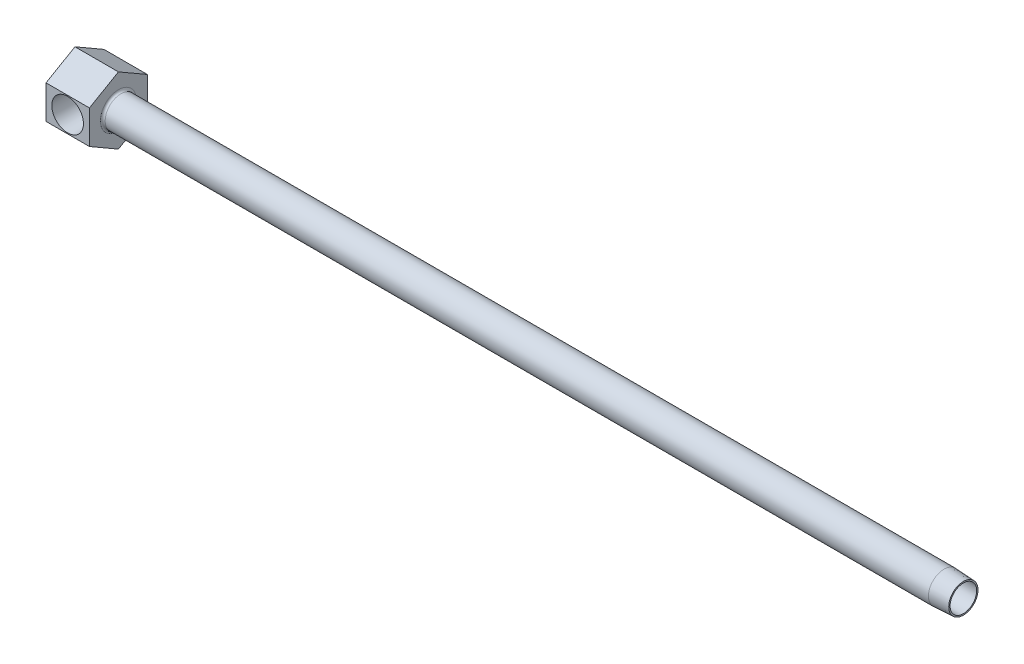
ISO-10303-21;
HEADER;
FILE_DESCRIPTION(('STEP AP214'),'2;1');
FILE_NAME('part.step','',(''),(''),'','','');
FILE_SCHEMA(('AUTOMOTIVE_DESIGN { 1 0 10303 214 1 1 1 1 }'));
ENDSEC;
DATA;
#1=APPLICATION_CONTEXT('core data for automotive mechanical design processes');
#2=APPLICATION_PROTOCOL_DEFINITION('international standard','automotive_design',2000,#1);
#3=PRODUCT_CONTEXT('',#1,'mechanical');
#4=PRODUCT('Part','Part','',(#3));
#5=PRODUCT_RELATED_PRODUCT_CATEGORY('part','',(#4));
#6=PRODUCT_DEFINITION_FORMATION('','',#4);
#7=PRODUCT_DEFINITION_CONTEXT('part definition',#1,'design');
#8=PRODUCT_DEFINITION('design','',#6,#7);
#9=PRODUCT_DEFINITION_SHAPE('','',#8);
#10=(LENGTH_UNIT() NAMED_UNIT(*) SI_UNIT(.MILLI.,.METRE.));
#11=(NAMED_UNIT(*) PLANE_ANGLE_UNIT() SI_UNIT($,.RADIAN.));
#12=(NAMED_UNIT(*) SI_UNIT($,.STERADIAN.) SOLID_ANGLE_UNIT());
#13=UNCERTAINTY_MEASURE_WITH_UNIT(LENGTH_MEASURE(1.E-05),#10,'distance_accuracy_value','');
#14=(GEOMETRIC_REPRESENTATION_CONTEXT(3) GLOBAL_UNCERTAINTY_ASSIGNED_CONTEXT((#13)) GLOBAL_UNIT_ASSIGNED_CONTEXT((#10,
#11,#12)) REPRESENTATION_CONTEXT('',''));
#15=CARTESIAN_POINT('',(0.,0.,0.));
#16=DIRECTION('',(0.,0.,1.));
#17=DIRECTION('',(1.,0.,0.));
#18=AXIS2_PLACEMENT_3D('',#15,#16,#17);
#19=CARTESIAN_POINT('',(7.14375,0.,9.525));
#20=DIRECTION('',(1.,0.,0.));
#21=DIRECTION('',(0.,0.,-1.));
#22=AXIS2_PLACEMENT_3D('',#19,#20,#21);
#23=PLANE('',#22);
#24=DIRECTION('',(0.,0.,1.));
#25=VECTOR('',#24,1.);
#26=CARTESIAN_POINT('',(7.14375,4.21628045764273,19.05));
#27=LINE('',#26,#25);
#28=CARTESIAN_POINT('',(7.14375,4.21628045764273,8.39289543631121));
#29=VERTEX_POINT('',#28);
#30=CARTESIAN_POINT('',(7.14375,4.21628045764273,10.16));
#31=VERTEX_POINT('',#30);
#32=EDGE_CURVE('E280',#29,#31,#27,.T.);
#33=ORIENTED_EDGE('',*,*,#32,.F.);
#34=CARTESIAN_POINT('',(7.14375,0.,9.525));
#35=DIRECTION('',(1.,0.,0.));
#36=DIRECTION('',(0.,0.,-1.));
#37=AXIS2_PLACEMENT_3D('',#34,#35,#36);
#38=CIRCLE('',#37,4.365625);
#39=CARTESIAN_POINT('',(7.14375,4.31919629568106,10.16));
#40=VERTEX_POINT('',#39);
#41=EDGE_CURVE('E163',#29,#40,#38,.T.);
#42=ORIENTED_EDGE('',*,*,#41,.T.);
#43=DIRECTION('',(0.,1.,0.));
#44=VECTOR('',#43,1.);
#45=CARTESIAN_POINT('',(7.14375,0.,10.16));
#46=LINE('',#45,#44);
#47=EDGE_CURVE('E153',#31,#40,#46,.T.);
#48=ORIENTED_EDGE('',*,*,#47,.F.);
#49=EDGE_LOOP('',(#33,#42,#48));
#50=FACE_BOUND('',#49,.T.);
#51=ADVANCED_FACE('F15',(#50),#23,.T.);
#52=CARTESIAN_POINT('',(14.2875,5.4992613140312,19.05));
#53=DIRECTION('',(0.,0.,-1.));
#54=DIRECTION('',(-1.,0.,0.));
#55=AXIS2_PLACEMENT_3D('',#52,#53,#54);
#56=PLANE('',#55);
#57=CARTESIAN_POINT('',(7.112,0.,19.05));
#58=DIRECTION('',(0.,0.,1.));
#59=DIRECTION('',(1.,0.,0.));
#60=AXIS2_PLACEMENT_3D('',#57,#58,#59);
#61=CIRCLE('',#60,5.2023645);
#62=CARTESIAN_POINT('',(12.3143645,0.,19.05));
#63=VERTEX_POINT('',#62);
#64=EDGE_CURVE('E269',#63,#63,#61,.T.);
#65=ORIENTED_EDGE('',*,*,#64,.F.);
#66=EDGE_LOOP('',(#65));
#67=FACE_BOUND('',#66,.T.);
#68=DIRECTION('',(0.,-1.,0.));
#69=VECTOR('',#68,1.);
#70=CARTESIAN_POINT('',(0.,5.4992613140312,19.05));
#71=LINE('',#70,#69);
#72=CARTESIAN_POINT('',(0.,5.4992613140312,19.05));
#73=VERTEX_POINT('',#72);
#74=CARTESIAN_POINT('',(0.,-5.49926131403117,19.05));
#75=VERTEX_POINT('',#74);
#76=EDGE_CURVE('E178',#73,#75,#71,.T.);
#77=ORIENTED_EDGE('',*,*,#76,.T.);
#78=DIRECTION('',(-1.,0.,0.));
#79=VECTOR('',#78,1.);
#80=CARTESIAN_POINT('',(14.2875,-5.49926131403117,19.05));
#81=LINE('',#80,#79);
#82=CARTESIAN_POINT('',(14.2875,-5.49926131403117,19.05));
#83=VERTEX_POINT('',#82);
#84=EDGE_CURVE('E201',#83,#75,#81,.T.);
#85=ORIENTED_EDGE('',*,*,#84,.F.);
#86=DIRECTION('',(0.,-1.,0.));
#87=VECTOR('',#86,1.);
#88=CARTESIAN_POINT('',(14.2875,5.4992613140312,19.05));
#89=LINE('',#88,#87);
#90=CARTESIAN_POINT('',(14.2875,5.4992613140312,19.05));
#91=VERTEX_POINT('',#90);
#92=EDGE_CURVE('E194',#91,#83,#89,.T.);
#93=ORIENTED_EDGE('',*,*,#92,.F.);
#94=DIRECTION('',(-1.,0.,0.));
#95=VECTOR('',#94,1.);
#96=CARTESIAN_POINT('',(14.2875,5.4992613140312,19.05));
#97=LINE('',#96,#95);
#98=EDGE_CURVE('E204',#91,#73,#97,.T.);
#99=ORIENTED_EDGE('',*,*,#98,.T.);
#100=EDGE_LOOP('',(#77,#85,#93,#99));
#101=FACE_BOUND('',#100,.T.);
#102=ADVANCED_FACE('F119',(#67,#101),#56,.F.);
#103=CARTESIAN_POINT('',(14.2875,-5.49926131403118,0.));
#104=DIRECTION('',(1.,0.,0.));
#105=DIRECTION('',(0.,1.,0.));
#106=AXIS2_PLACEMENT_3D('',#103,#104,#105);
#107=PLANE('',#106);
#108=CARTESIAN_POINT('',(14.2875,0.,9.525));
#109=DIRECTION('',(1.,0.,0.));
#110=DIRECTION('',(0.,1.,0.));
#111=AXIS2_PLACEMENT_3D('',#108,#109,#110);
#112=CIRCLE('',#111,5.9309);
#113=CARTESIAN_POINT('',(14.2875,5.9309,9.525));
#114=VERTEX_POINT('',#113);
#115=EDGE_CURVE('E216',#114,#114,#112,.F.);
#116=ORIENTED_EDGE('',*,*,#115,.T.);
#117=EDGE_LOOP('',(#116));
#118=FACE_BOUND('',#117,.T.);
#119=DIRECTION('',(0.,0.5,-0.866025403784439));
#120=VECTOR('',#119,1.);
#121=CARTESIAN_POINT('',(14.2875,-10.9985226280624,9.525));
#122=LINE('',#121,#120);
#123=CARTESIAN_POINT('',(14.2875,-10.9985226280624,9.525));
#124=VERTEX_POINT('',#123);
#125=CARTESIAN_POINT('',(14.2875,-5.49926131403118,0.));
#126=VERTEX_POINT('',#125);
#127=EDGE_CURVE('E184',#124,#126,#122,.T.);
#128=ORIENTED_EDGE('',*,*,#127,.T.);
#129=DIRECTION('',(0.,1.,0.));
#130=VECTOR('',#129,1.);
#131=CARTESIAN_POINT('',(14.2875,-5.49926131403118,0.));
#132=LINE('',#131,#130);
#133=CARTESIAN_POINT('',(14.2875,5.49926131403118,0.));
#134=VERTEX_POINT('',#133);
#135=EDGE_CURVE('E188',#126,#134,#132,.T.);
#136=ORIENTED_EDGE('',*,*,#135,.T.);
#137=DIRECTION('',(0.,0.5,0.866025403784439));
#138=VECTOR('',#137,1.);
#139=CARTESIAN_POINT('',(14.2875,5.49926131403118,0.));
#140=LINE('',#139,#138);
#141=CARTESIAN_POINT('',(14.2875,10.9985226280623,9.525));
#142=VERTEX_POINT('',#141);
#143=EDGE_CURVE('E190',#134,#142,#140,.T.);
#144=ORIENTED_EDGE('',*,*,#143,.T.);
#145=DIRECTION('',(0.,-0.5,0.86602540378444));
#146=VECTOR('',#145,1.);
#147=CARTESIAN_POINT('',(14.2875,10.9985226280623,9.525));
#148=LINE('',#147,#146);
#149=EDGE_CURVE('E192',#142,#91,#148,.T.);
#150=ORIENTED_EDGE('',*,*,#149,.T.);
#151=ORIENTED_EDGE('',*,*,#92,.T.);
#152=DIRECTION('',(0.,-0.5,-0.866025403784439));
#153=VECTOR('',#152,1.);
#154=CARTESIAN_POINT('',(14.2875,-5.49926131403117,19.05));
#155=LINE('',#154,#153);
#156=EDGE_CURVE('E38',#83,#124,#155,.T.);
#157=ORIENTED_EDGE('',*,*,#156,.T.);
#158=EDGE_LOOP('',(#128,#136,#144,#150,#151,#157));
#159=FACE_BOUND('',#158,.T.);
#160=ADVANCED_FACE('F127',(#118,#159),#107,.T.);
#161=CARTESIAN_POINT('',(14.2875,-10.9985226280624,9.525));
#162=DIRECTION('',(0.,0.866025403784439,0.5));
#163=DIRECTION('',(0.,-0.5,0.866025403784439));
#164=AXIS2_PLACEMENT_3D('',#161,#162,#163);
#165=PLANE('',#164);
#166=DIRECTION('',(0.,0.5,-0.866025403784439));
#167=VECTOR('',#166,1.);
#168=CARTESIAN_POINT('',(0.,-10.9985226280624,9.525));
#169=LINE('',#168,#167);
#170=CARTESIAN_POINT('',(0.,-10.9985226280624,9.525));
#171=VERTEX_POINT('',#170);
#172=CARTESIAN_POINT('',(0.,-5.49926131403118,0.));
#173=VERTEX_POINT('',#172);
#174=EDGE_CURVE('E166',#171,#173,#169,.T.);
#175=ORIENTED_EDGE('',*,*,#174,.T.);
#176=DIRECTION('',(-1.,0.,0.));
#177=VECTOR('',#176,1.);
#178=CARTESIAN_POINT('',(14.2875,-5.49926131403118,0.));
#179=LINE('',#178,#177);
#180=EDGE_CURVE('E213',#126,#173,#179,.T.);
#181=ORIENTED_EDGE('',*,*,#180,.F.);
#182=ORIENTED_EDGE('',*,*,#127,.F.);
#183=DIRECTION('',(-1.,0.,0.));
#184=VECTOR('',#183,1.);
#185=CARTESIAN_POINT('',(14.2875,-10.9985226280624,9.525));
#186=LINE('',#185,#184);
#187=EDGE_CURVE('E197',#124,#171,#186,.T.);
#188=ORIENTED_EDGE('',*,*,#187,.T.);
#189=EDGE_LOOP('',(#175,#181,#182,#188));
#190=FACE_BOUND('',#189,.T.);
#191=ADVANCED_FACE('F301',(#190),#165,.F.);
#192=CARTESIAN_POINT('',(14.2875,-5.49926131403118,0.));
#193=DIRECTION('',(0.,0.,1.));
#194=DIRECTION('',(0.,-1.,0.));
#195=AXIS2_PLACEMENT_3D('',#192,#193,#194);
#196=PLANE('',#195);
#197=DIRECTION('',(0.,1.,0.));
#198=VECTOR('',#197,1.);
#199=CARTESIAN_POINT('',(0.,-5.49926131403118,0.));
#200=LINE('',#199,#198);
#201=CARTESIAN_POINT('',(0.,5.49926131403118,0.));
#202=VERTEX_POINT('',#201);
#203=EDGE_CURVE('E169',#173,#202,#200,.T.);
#204=ORIENTED_EDGE('',*,*,#203,.T.);
#205=DIRECTION('',(-1.,0.,0.));
#206=VECTOR('',#205,1.);
#207=CARTESIAN_POINT('',(14.2875,5.49926131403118,0.));
#208=LINE('',#207,#206);
#209=EDGE_CURVE('E210',#134,#202,#208,.T.);
#210=ORIENTED_EDGE('',*,*,#209,.F.);
#211=ORIENTED_EDGE('',*,*,#135,.F.);
#212=ORIENTED_EDGE('',*,*,#180,.T.);
#213=EDGE_LOOP('',(#204,#210,#211,#212));
#214=FACE_BOUND('',#213,.T.);
#215=ADVANCED_FACE('F307',(#214),#196,.F.);
#216=CARTESIAN_POINT('',(14.2875,5.49926131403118,0.));
#217=DIRECTION('',(0.,-0.866025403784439,0.5));
#218=DIRECTION('',(0.,-0.5,-0.866025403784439));
#219=AXIS2_PLACEMENT_3D('',#216,#217,#218);
#220=PLANE('',#219);
#221=DIRECTION('',(0.,0.5,0.866025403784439));
#222=VECTOR('',#221,1.);
#223=CARTESIAN_POINT('',(0.,5.49926131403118,0.));
#224=LINE('',#223,#222);
#225=CARTESIAN_POINT('',(0.,10.9985226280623,9.525));
#226=VERTEX_POINT('',#225);
#227=EDGE_CURVE('E172',#202,#226,#224,.T.);
#228=ORIENTED_EDGE('',*,*,#227,.T.);
#229=DIRECTION('',(-1.,0.,0.));
#230=VECTOR('',#229,1.);
#231=CARTESIAN_POINT('',(14.2875,10.9985226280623,9.525));
#232=LINE('',#231,#230);
#233=EDGE_CURVE('E207',#142,#226,#232,.T.);
#234=ORIENTED_EDGE('',*,*,#233,.F.);
#235=ORIENTED_EDGE('',*,*,#143,.F.);
#236=ORIENTED_EDGE('',*,*,#209,.T.);
#237=EDGE_LOOP('',(#228,#234,#235,#236));
#238=FACE_BOUND('',#237,.T.);
#239=ADVANCED_FACE('F309',(#238),#220,.F.);
#240=CARTESIAN_POINT('',(14.2875,10.9985226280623,9.525));
#241=DIRECTION('',(0.,-0.86602540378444,-0.5));
#242=DIRECTION('',(0.,0.5,-0.86602540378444));
#243=AXIS2_PLACEMENT_3D('',#240,#241,#242);
#244=PLANE('',#243);
#245=DIRECTION('',(0.,-0.5,0.86602540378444));
#246=VECTOR('',#245,1.);
#247=CARTESIAN_POINT('',(0.,10.9985226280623,9.525));
#248=LINE('',#247,#246);
#249=EDGE_CURVE('E175',#226,#73,#248,.T.);
#250=ORIENTED_EDGE('',*,*,#249,.T.);
#251=ORIENTED_EDGE('',*,*,#98,.F.);
#252=ORIENTED_EDGE('',*,*,#149,.F.);
#253=ORIENTED_EDGE('',*,*,#233,.T.);
#254=EDGE_LOOP('',(#250,#251,#252,#253));
#255=FACE_BOUND('',#254,.T.);
#256=ADVANCED_FACE('F312',(#255),#244,.F.);
#257=CARTESIAN_POINT('',(14.2875,-5.49926131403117,19.05));
#258=DIRECTION('',(0.,0.866025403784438,-0.5));
#259=DIRECTION('',(0.,0.5,0.866025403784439));
#260=AXIS2_PLACEMENT_3D('',#257,#258,#259);
#261=PLANE('',#260);
#262=DIRECTION('',(0.,-0.5,-0.866025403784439));
#263=VECTOR('',#262,1.);
#264=CARTESIAN_POINT('',(0.,-5.49926131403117,19.05));
#265=LINE('',#264,#263);
#266=EDGE_CURVE('E181',#75,#171,#265,.T.);
#267=ORIENTED_EDGE('',*,*,#266,.T.);
#268=ORIENTED_EDGE('',*,*,#187,.F.);
#269=ORIENTED_EDGE('',*,*,#156,.F.);
#270=ORIENTED_EDGE('',*,*,#84,.T.);
#271=EDGE_LOOP('',(#267,#268,#269,#270));
#272=FACE_BOUND('',#271,.T.);
#273=ADVANCED_FACE('F296',(#272),#261,.F.);
#274=CARTESIAN_POINT('',(0.,-5.49926131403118,0.));
#275=DIRECTION('',(1.,0.,0.));
#276=DIRECTION('',(0.,1.,0.));
#277=AXIS2_PLACEMENT_3D('',#274,#275,#276);
#278=PLANE('',#277);
#279=ORIENTED_EDGE('',*,*,#174,.F.);
#280=ORIENTED_EDGE('',*,*,#266,.F.);
#281=ORIENTED_EDGE('',*,*,#76,.F.);
#282=ORIENTED_EDGE('',*,*,#249,.F.);
#283=ORIENTED_EDGE('',*,*,#227,.F.);
#284=ORIENTED_EDGE('',*,*,#203,.F.);
#285=EDGE_LOOP('',(#279,#280,#281,#282,#283,#284));
#286=FACE_BOUND('',#285,.T.);
#287=ADVANCED_FACE('F141',(#286),#278,.F.);
#288=CARTESIAN_POINT('',(68.0114010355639,0.,9.525));
#289=DIRECTION('',(-1.,0.,0.));
#290=DIRECTION('',(0.,0.,1.));
#291=AXIS2_PLACEMENT_3D('',#288,#289,#290);
#292=CYLINDRICAL_SURFACE('',#291,5.1435);
#293=CARTESIAN_POINT('',(285.75,0.,9.525));
#294=DIRECTION('',(-1.,0.,0.));
#295=DIRECTION('',(0.,0.,1.));
#296=AXIS2_PLACEMENT_3D('',#293,#294,#295);
#297=CIRCLE('',#296,5.1435);
#298=CARTESIAN_POINT('',(285.75,0.,14.6685));
#299=VERTEX_POINT('',#298);
#300=EDGE_CURVE('E10',#299,#299,#297,.F.);
#301=ORIENTED_EDGE('',*,*,#300,.F.);
#302=EDGE_LOOP('',(#301));
#303=FACE_BOUND('',#302,.T.);
#304=CARTESIAN_POINT('',(15.0749,0.,9.525));
#305=DIRECTION('',(1.,0.,0.));
#306=DIRECTION('',(0.,1.,0.));
#307=AXIS2_PLACEMENT_3D('',#304,#305,#306);
#308=CIRCLE('',#307,5.1435);
#309=CARTESIAN_POINT('',(15.0749,5.1435,9.525));
#310=VERTEX_POINT('',#309);
#311=EDGE_CURVE('E219',#310,#310,#308,.T.);
#312=ORIENTED_EDGE('',*,*,#311,.T.);
#313=EDGE_LOOP('',(#312));
#314=FACE_BOUND('',#313,.T.);
#315=ADVANCED_FACE('F17',(#303,#314),#292,.T.);
#316=CARTESIAN_POINT('',(7.14375,-4.31919629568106,10.16));
#317=VERTEX_POINT('',#316);
#318=CARTESIAN_POINT('',(7.14375,-4.21628045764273,10.16));
#319=VERTEX_POINT('',#318);
#320=EDGE_CURVE('E146',#317,#319,#46,.T.);
#321=ORIENTED_EDGE('',*,*,#320,.F.);
#322=CARTESIAN_POINT('',(7.14375,-4.21628045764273,8.39289543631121));
#323=VERTEX_POINT('',#322);
#324=EDGE_CURVE('E148',#317,#323,#38,.T.);
#325=ORIENTED_EDGE('',*,*,#324,.T.);
#326=DIRECTION('',(0.,0.,1.));
#327=VECTOR('',#326,1.);
#328=CARTESIAN_POINT('',(7.14375,-4.21628045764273,19.05));
#329=LINE('',#328,#327);
#330=EDGE_CURVE('E149',#319,#323,#329,.F.);
#331=ORIENTED_EDGE('',*,*,#330,.F.);
#332=EDGE_LOOP('',(#321,#325,#331));
#333=FACE_BOUND('',#332,.T.);
#334=ADVANCED_FACE('F122',(#333),#23,.T.);
#335=CARTESIAN_POINT('',(66.1375087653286,0.,9.525));
#336=DIRECTION('',(1.,0.,0.));
#337=DIRECTION('',(0.,0.,-1.));
#338=AXIS2_PLACEMENT_3D('',#335,#336,#337);
#339=CYLINDRICAL_SURFACE('',#338,4.365625);
#340=DIRECTION('',(1.,0.,0.));
#341=VECTOR('',#340,1.);
#342=CARTESIAN_POINT('',(66.1375087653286,4.31919629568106,10.16));
#343=LINE('',#342,#341);
#344=CARTESIAN_POINT('',(9.50166012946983,4.31919629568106,10.16));
#345=VERTEX_POINT('',#344);
#346=EDGE_CURVE('E23',#40,#345,#343,.T.);
#347=ORIENTED_EDGE('',*,*,#346,.F.);
#348=ORIENTED_EDGE('',*,*,#41,.F.);
#349=CARTESIAN_POINT('',(11.0152606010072,1.5945487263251,5.461));
#350=CARTESIAN_POINT('',(10.9690910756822,1.7075595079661,5.50534166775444));
#351=CARTESIAN_POINT('',(10.9186455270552,1.81703423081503,5.55373339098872));
#352=CARTESIAN_POINT('',(10.810302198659,2.02846645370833,5.65746242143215));
#353=CARTESIAN_POINT('',(10.7524192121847,2.13043826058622,5.71278593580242));
#354=CARTESIAN_POINT('',(10.5698905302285,2.42358040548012,5.88682744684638));
#355=CARTESIAN_POINT('',(10.4356317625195,2.6037024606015,6.01432367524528));
#356=CARTESIAN_POINT('',(10.2004726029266,2.87382153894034,6.2358690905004));
#357=CARTESIAN_POINT('',(10.1051285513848,2.97281573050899,6.32528321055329));
#358=CARTESIAN_POINT('',(9.90783434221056,3.15907014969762,6.50903483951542));
#359=CARTESIAN_POINT('',(9.80588273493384,3.2463277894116,6.60337342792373));
#360=CARTESIAN_POINT('',(9.59613587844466,3.40951469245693,6.79556583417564));
#361=CARTESIAN_POINT('',(9.48833347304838,3.48542963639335,6.89342390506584));
#362=CARTESIAN_POINT('',(9.26745878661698,3.62617881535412,7.09103053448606));
#363=CARTESIAN_POINT('',(9.15438825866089,3.69101670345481,7.19077845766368));
#364=CARTESIAN_POINT('',(8.91700112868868,3.81296593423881,7.39547820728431));
#365=CARTESIAN_POINT('',(8.79240497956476,3.86952009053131,7.50043788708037));
#366=CARTESIAN_POINT('',(8.53587575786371,3.97111492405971,7.70779573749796));
#367=CARTESIAN_POINT('',(8.40392330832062,4.01612325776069,7.81018600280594));
#368=CARTESIAN_POINT('',(8.16304729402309,4.0847277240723,7.98226690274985));
#369=CARTESIAN_POINT('',(8.0562781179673,4.11086974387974,8.05387458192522));
#370=CARTESIAN_POINT('',(7.89027521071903,4.14432560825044,8.15224503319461));
#371=CARTESIAN_POINT('',(7.83425575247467,4.15448196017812,8.18339689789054));
#372=CARTESIAN_POINT('',(7.71975817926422,4.17277321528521,8.24142733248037));
#373=CARTESIAN_POINT('',(7.6612817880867,4.18090950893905,8.26830883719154));
#374=CARTESIAN_POINT('',(7.52931857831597,4.19631734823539,8.32062856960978));
#375=CARTESIAN_POINT('',(7.45518069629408,4.2030846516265,8.34468558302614));
#376=CARTESIAN_POINT('',(7.30234246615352,4.21282137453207,8.37996487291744));
#377=CARTESIAN_POINT('',(7.22358315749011,4.21571837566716,8.39094201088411));
#378=CARTESIAN_POINT('',(7.14374999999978,4.21628045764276,8.39289543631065));
#379=B_SPLINE_CURVE_WITH_KNOTS('',3,(#349,#350,#351,#352,#353,#354,#355,#356,#357,#358,#359,
#360,#361,#362,#363,#364,#365,#366,#367,#368,#369,#370,#371,#372,#373,#374,#375,#376,#377,#378),
.UNSPECIFIED.,.F.,.F.,(4,2,2,2,2,2,2,2,2,2,2,2,2,2,4),(0.,0.389178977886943,0.777595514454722,
1.54850925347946,2.03989074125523,2.5313804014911,3.02348538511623,3.51542776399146,
4.03226982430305,4.5505442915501,4.94339994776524,5.13792303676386,5.33231185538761,
5.56585330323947,5.80370611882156),.UNSPECIFIED.);
#380=CARTESIAN_POINT('',(11.0152606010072,1.5945487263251,5.461));
#381=VERTEX_POINT('',#380);
#382=EDGE_CURVE('E222',#381,#29,#379,.T.);
#383=ORIENTED_EDGE('',*,*,#382,.F.);
#384=CARTESIAN_POINT('',(11.038608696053,-1.66986531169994,5.4913625));
#385=CARTESIAN_POINT('',(11.0105354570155,-1.5831922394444,5.45544731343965));
#386=CARTESIAN_POINT('',(10.985979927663,-1.49442111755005,5.422003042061));
#387=CARTESIAN_POINT('',(10.9431209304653,-1.31365154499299,5.36062405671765));
#388=CARTESIAN_POINT('',(10.9248095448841,-1.22165734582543,5.3326823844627));
#389=CARTESIAN_POINT('',(10.8936059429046,-1.03529168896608,5.28281066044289));
#390=CARTESIAN_POINT('',(10.8807075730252,-0.94092306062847,5.26087379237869));
#391=CARTESIAN_POINT('',(10.8594086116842,-0.750424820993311,5.22325970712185));
#392=CARTESIAN_POINT('',(10.8510094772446,-0.654294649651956,5.20758451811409));
#393=CARTESIAN_POINT('',(10.8381415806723,-0.463156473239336,5.18296779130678));
#394=CARTESIAN_POINT('',(10.8335877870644,-0.368172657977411,5.1738812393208));
#395=CARTESIAN_POINT('',(10.8276558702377,-0.177678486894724,5.16194794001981));
#396=CARTESIAN_POINT('',(10.8262790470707,-0.0821679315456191,5.15910374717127));
#397=CARTESIAN_POINT('',(10.826564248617,0.108822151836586,5.15968693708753));
#398=CARTESIAN_POINT('',(10.828226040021,0.204301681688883,5.16311383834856));
#399=CARTESIAN_POINT('',(10.8347557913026,0.3946850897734,5.17620642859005));
#400=CARTESIAN_POINT('',(10.8396224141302,0.489589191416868,5.18586951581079));
#401=CARTESIAN_POINT('',(10.8530224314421,0.678329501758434,5.2113452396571));
#402=CARTESIAN_POINT('',(10.861556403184,0.772165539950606,5.22715884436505));
#403=CARTESIAN_POINT('',(10.882977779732,0.958108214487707,5.26475262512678));
#404=CARTESIAN_POINT('',(10.8958637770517,1.05021539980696,5.28653087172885));
#405=CARTESIAN_POINT('',(10.9268394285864,1.23213175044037,5.33579934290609));
#406=CARTESIAN_POINT('',(10.9449350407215,1.32193815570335,5.36329609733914));
#407=CARTESIAN_POINT('',(10.9870994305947,1.49845562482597,5.42352620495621));
#408=CARTESIAN_POINT('',(11.0111754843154,1.58516276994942,5.45626591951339));
#409=CARTESIAN_POINT('',(11.038608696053,1.66986531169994,5.4913625));
#410=B_SPLINE_CURVE_WITH_KNOTS('',3,(#384,#385,#386,#387,#388,#389,#390,#391,#392,#393,#394,
#395,#396,#397,#398,#399,#400,#401,#402,#403,#404,#405,#406,#407,#408,#409),.UNSPECIFIED.,.F.,
.F.,(4,2,2,2,2,2,2,2,2,2,2,2,4),(0.,0.293591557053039,0.586809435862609,0.879693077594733,
1.17267150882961,1.45898777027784,1.74542117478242,2.03183258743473,2.31812458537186,
2.60446166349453,2.89070622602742,3.17727945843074,3.46420306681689),.UNSPECIFIED.);
#411=CARTESIAN_POINT('',(11.0152606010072,-1.5945487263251,5.461));
#412=VERTEX_POINT('',#411);
#413=EDGE_CURVE('E227',#412,#381,#410,.T.);
#414=ORIENTED_EDGE('',*,*,#413,.F.);
#415=CARTESIAN_POINT('',(7.14375,-4.21628045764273,8.39289543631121));
#416=CARTESIAN_POINT('',(7.18362399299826,-4.21598583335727,8.39181806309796));
#417=CARTESIAN_POINT('',(7.22338201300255,-4.21511517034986,8.38855660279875));
#418=CARTESIAN_POINT('',(7.30220974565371,-4.21229002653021,8.3781194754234));
#419=CARTESIAN_POINT('',(7.34128135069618,-4.21033927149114,8.37095726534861));
#420=CARTESIAN_POINT('',(7.45558593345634,-4.20306181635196,8.34463096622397));
#421=CARTESIAN_POINT('',(7.52959005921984,-4.19629141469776,8.32054287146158));
#422=CARTESIAN_POINT('',(7.67793141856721,-4.17895935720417,8.2616842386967));
#423=CARTESIAN_POINT('',(7.75200183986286,-4.16818767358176,8.22634138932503));
#424=CARTESIAN_POINT('',(7.89635080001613,-4.14345087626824,8.14945009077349));
#425=CARTESIAN_POINT('',(7.96662283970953,-4.12948049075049,8.10789143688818));
#426=CARTESIAN_POINT('',(8.10525974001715,-4.09836535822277,8.02024615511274));
#427=CARTESIAN_POINT('',(8.17357097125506,-4.08117012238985,7.97409391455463));
#428=CARTESIAN_POINT('',(8.30769836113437,-4.04390532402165,7.87936489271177));
#429=CARTESIAN_POINT('',(8.37351346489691,-4.02383456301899,7.83078710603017));
#430=CARTESIAN_POINT('',(8.57859672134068,-3.95588469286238,7.67482924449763));
#431=CARTESIAN_POINT('',(8.71418056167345,-3.90283307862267,7.56482866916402));
#432=CARTESIAN_POINT('',(8.97841531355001,-3.78358080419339,7.34346052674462));
#433=CARTESIAN_POINT('',(9.10705932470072,-3.71736735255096,7.23209172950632));
#434=CARTESIAN_POINT('',(9.35705912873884,-3.57190642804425,7.01153592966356));
#435=CARTESIAN_POINT('',(9.47845600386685,-3.49274436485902,6.90233956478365));
#436=CARTESIAN_POINT('',(9.71438396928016,-3.32067953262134,6.68762551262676));
#437=CARTESIAN_POINT('',(9.82891987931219,-3.22778657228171,6.58210526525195));
#438=CARTESIAN_POINT('',(10.0969445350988,-2.98549279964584,6.33327532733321));
#439=CARTESIAN_POINT('',(10.2465325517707,-2.82876640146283,6.19275827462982));
#440=CARTESIAN_POINT('',(10.5251240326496,-2.48539491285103,5.92944140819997));
#441=CARTESIAN_POINT('',(10.6541872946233,-2.29884003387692,5.80659022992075));
#442=CARTESIAN_POINT('',(10.815064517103,-2.01834728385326,5.65289947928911));
#443=CARTESIAN_POINT('',(10.8584525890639,-1.93670806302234,5.61137999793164));
#444=CARTESIAN_POINT('',(10.9405236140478,-1.76894321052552,5.53274400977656));
#445=CARTESIAN_POINT('',(10.9792015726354,-1.6828129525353,5.49563217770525));
#446=CARTESIAN_POINT('',(11.0152606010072,-1.5945487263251,5.461));
#447=B_SPLINE_CURVE_WITH_KNOTS('',3,(#415,#416,#417,#418,#419,#420,#421,#422,#423,#424,#425,
#426,#427,#428,#429,#430,#431,#432,#433,#434,#435,#436,#437,#438,#439,#440,#441,#442,#443,#444,
#445,#446),.UNSPECIFIED.,.F.,.F.,(4,2,2,2,2,2,2,2,2,2,2,2,2,2,2,4),(0.,0.119524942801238,
0.238640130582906,0.471907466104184,0.719716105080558,0.967936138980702,1.2204276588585,
1.47302472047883,2.01967972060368,2.56686861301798,3.1105838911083,3.65391262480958,
4.4259772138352,5.19574951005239,5.49953103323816,5.80363192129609),.UNSPECIFIED.);
#448=EDGE_CURVE('E162',#323,#412,#447,.T.);
#449=ORIENTED_EDGE('',*,*,#448,.F.);
#450=ORIENTED_EDGE('',*,*,#324,.F.);
#451=DIRECTION('',(1.,0.,0.));
#452=VECTOR('',#451,1.);
#453=CARTESIAN_POINT('',(66.1375087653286,-4.31919629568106,10.16));
#454=LINE('',#453,#452);
#455=CARTESIAN_POINT('',(9.50166012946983,-4.31919629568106,10.16));
#456=VERTEX_POINT('',#455);
#457=EDGE_CURVE('E160',#456,#317,#454,.F.);
#458=ORIENTED_EDGE('',*,*,#457,.F.);
#459=CARTESIAN_POINT('',(9.50159462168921,4.31922569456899,10.1598));
#460=CARTESIAN_POINT('',(9.52205476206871,4.31004461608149,10.2222542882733));
#461=CARTESIAN_POINT('',(9.54440879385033,4.29961032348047,10.2838517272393));
#462=CARTESIAN_POINT('',(9.592244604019,4.27639816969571,10.4052958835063));
#463=CARTESIAN_POINT('',(9.61772301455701,4.26362282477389,10.4651444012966));
#464=CARTESIAN_POINT('',(9.6977084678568,4.22211002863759,10.641720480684));
#465=CARTESIAN_POINT('',(9.75594525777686,4.19010742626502,10.7559937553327));
#466=CARTESIAN_POINT('',(9.87844694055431,4.11827910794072,10.9783012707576));
#467=CARTESIAN_POINT('',(9.94270165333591,4.07846648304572,11.0863455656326));
#468=CARTESIAN_POINT('',(10.0748723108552,3.9913538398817,11.2972300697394));
#469=CARTESIAN_POINT('',(10.1427929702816,3.94404402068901,11.4000632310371));
#470=CARTESIAN_POINT('',(10.298774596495,3.82856370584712,11.6276502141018));
#471=CARTESIAN_POINT('',(10.3873705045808,3.75819622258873,11.7509249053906));
#472=CARTESIAN_POINT('',(10.5646676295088,3.60591330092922,11.9899830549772));
#473=CARTESIAN_POINT('',(10.6533688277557,3.52399966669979,12.1057676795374));
#474=CARTESIAN_POINT('',(10.828903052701,3.34837324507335,12.3298815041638));
#475=CARTESIAN_POINT('',(10.9157338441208,3.25464716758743,12.4382020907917));
#476=CARTESIAN_POINT('',(11.0854790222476,3.05533823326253,12.6465978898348));
#477=CARTESIAN_POINT('',(11.1683947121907,2.94975936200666,12.746675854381));
#478=CARTESIAN_POINT('',(11.3637298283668,2.67738871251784,12.9797077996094));
#479=CARTESIAN_POINT('',(11.4730979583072,2.50408908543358,13.1077769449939));
#480=CARTESIAN_POINT('',(11.6736784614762,2.13317678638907,13.3402290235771));
#481=CARTESIAN_POINT('',(11.764930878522,1.93561933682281,13.444664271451));
#482=CARTESIAN_POINT('',(11.9092563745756,1.55445058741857,13.608817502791));
#483=CARTESIAN_POINT('',(11.9662034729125,1.37434002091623,13.6731460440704));
#484=CARTESIAN_POINT('',(12.036275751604,1.09545803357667,13.7520594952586));
#485=CARTESIAN_POINT('',(12.0570798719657,1.00100886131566,13.7754393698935));
#486=CARTESIAN_POINT('',(12.093196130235,0.80976989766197,13.8159777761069));
#487=CARTESIAN_POINT('',(12.1085105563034,0.712981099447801,13.8331388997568));
#488=CARTESIAN_POINT('',(12.1334016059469,0.517219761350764,13.861011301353));
#489=CARTESIAN_POINT('',(12.1429475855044,0.418238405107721,13.8716881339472));
#490=CARTESIAN_POINT('',(12.1559671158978,0.219418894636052,13.8862461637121));
#491=CARTESIAN_POINT('',(12.159443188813,0.119581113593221,13.8901301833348));
#492=CARTESIAN_POINT('',(12.1602489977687,-0.0801622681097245,13.8910308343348));
#493=CARTESIAN_POINT('',(12.157578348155,-0.180067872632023,13.8880470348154));
#494=CARTESIAN_POINT('',(12.1461610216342,-0.379063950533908,13.87528173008));
#495=CARTESIAN_POINT('',(12.1374146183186,-0.478154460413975,13.8655005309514));
#496=CARTESIAN_POINT('',(12.1041501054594,-0.757548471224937,13.8282625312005));
#497=CARTESIAN_POINT('',(12.0725539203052,-0.936048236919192,13.7928583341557));
#498=CARTESIAN_POINT('',(11.9914510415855,-1.28332325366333,13.701614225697));
#499=CARTESIAN_POINT('',(11.9419389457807,-1.45209555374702,13.645768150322));
#500=CARTESIAN_POINT('',(11.8234161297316,-1.78986703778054,13.5113020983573));
#501=CARTESIAN_POINT('',(11.7531886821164,-1.95786359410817,13.4312490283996));
#502=CARTESIAN_POINT('',(11.5990616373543,-2.2774775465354,13.2539727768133));
#503=CARTESIAN_POINT('',(11.515160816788,-2.42909347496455,13.1567480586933));
#504=CARTESIAN_POINT('',(11.2893838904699,-2.79222476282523,12.8919364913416));
#505=CARTESIAN_POINT('',(11.1405152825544,-2.99235864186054,12.7145443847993));
#506=CARTESIAN_POINT('',(10.9077049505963,-3.26312100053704,12.4281267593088));
#507=CARTESIAN_POINT('',(10.8282461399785,-3.34869576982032,12.3289140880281));
#508=CARTESIAN_POINT('',(10.6676325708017,-3.51003537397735,12.1240974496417));
#509=CARTESIAN_POINT('',(10.5864785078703,-3.58580414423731,12.0184960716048));
#510=CARTESIAN_POINT('',(10.4220303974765,-3.72941202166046,11.798300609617));
#511=CARTESIAN_POINT('',(10.338734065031,-3.79700254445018,11.6835467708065));
#512=CARTESIAN_POINT('',(10.1740816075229,-3.92201333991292,11.4470806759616));
#513=CARTESIAN_POINT('',(10.092727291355,-3.97942442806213,11.3253622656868));
#514=CARTESIAN_POINT('',(9.93568225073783,-4.08324264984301,11.0754774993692));
#515=CARTESIAN_POINT('',(9.85994825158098,-4.12974154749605,10.9473767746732));
#516=CARTESIAN_POINT('',(9.71779756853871,-4.21155620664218,10.6828322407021));
#517=CARTESIAN_POINT('',(9.65135922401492,-4.24689821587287,10.5464089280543));
#518=CARTESIAN_POINT('',(9.57628126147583,-4.28419371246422,10.3652627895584));
#519=CARTESIAN_POINT('',(9.56028735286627,-4.29194911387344,10.3247361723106));
#520=CARTESIAN_POINT('',(9.52977406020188,-4.30640007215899,10.2428664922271));
#521=CARTESIAN_POINT('',(9.51525722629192,-4.31309380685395,10.2015221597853));
#522=CARTESIAN_POINT('',(9.50159462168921,-4.31922569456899,10.1598));
#523=B_SPLINE_CURVE_WITH_KNOTS('',3,(#459,#460,#461,#462,#463,#464,#465,#466,#467,#468,#469,
#470,#471,#472,#473,#474,#475,#476,#477,#478,#479,#480,#481,#482,#483,#484,#485,#486,#487,#488,
#489,#490,#491,#492,#493,#494,#495,#496,#497,#498,#499,#500,#501,#502,#503,#504,#505,#506,#507,
#508,#509,#510,#511,#512,#513,#514,#515,#516,#517,#518,#519,#520,#521,#522),.UNSPECIFIED.,.F.,
.F.,(4,2,2,2,2,2,2,2,2,2,2,2,2,2,2,2,2,2,2,2,2,2,2,2,2,2,2,2,2,2,2,4),(0.,0.19895577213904,
0.397698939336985,0.793542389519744,1.1887279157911,1.58443438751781,2.08580736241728,
2.58710208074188,3.08896592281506,3.5906615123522,4.3128774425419,5.03347872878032,
5.62940645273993,5.92758657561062,6.22564226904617,6.52526772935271,6.82476866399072,
7.12428839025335,7.4237946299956,7.97525228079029,8.52687635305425,9.12138980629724,
9.71595648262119,10.6287987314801,11.0881817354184,11.5473798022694,12.018174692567,
12.4893922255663,12.9564924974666,13.4224855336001,13.5552077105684,13.6881552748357),.UNSPECIFIED.);
#524=EDGE_CURVE('E241',#345,#456,#523,.T.);
#525=ORIENTED_EDGE('',*,*,#524,.F.);
#526=EDGE_LOOP('',(#347,#348,#383,#414,#449,#450,#458,#525));
#527=FACE_BOUND('',#526,.T.);
#528=CARTESIAN_POINT('',(292.1,0.,9.525));
#529=DIRECTION('',(1.,0.,0.));
#530=DIRECTION('',(0.,0.,-1.));
#531=AXIS2_PLACEMENT_3D('',#528,#529,#530);
#532=CIRCLE('',#531,4.365625);
#533=CARTESIAN_POINT('',(292.1,0.,5.159375));
#534=VERTEX_POINT('',#533);
#535=EDGE_CURVE('E267',#534,#534,#532,.T.);
#536=ORIENTED_EDGE('',*,*,#535,.T.);
#537=EDGE_LOOP('',(#536));
#538=FACE_BOUND('',#537,.T.);
#539=ADVANCED_FACE('F114',(#527,#538),#339,.F.);
#540=CARTESIAN_POINT('',(15.0749,0.,9.525));
#541=DIRECTION('',(1.,0.,0.));
#542=DIRECTION('',(0.,1.,0.));
#543=AXIS2_PLACEMENT_3D('',#540,#541,#542);
#544=TOROIDAL_SURFACE('',#543,5.9309,0.7874);
#545=ORIENTED_EDGE('',*,*,#311,.F.);
#546=EDGE_LOOP('',(#545));
#547=FACE_BOUND('',#546,.T.);
#548=ORIENTED_EDGE('',*,*,#115,.F.);
#549=EDGE_LOOP('',(#548));
#550=FACE_BOUND('',#549,.T.);
#551=ADVANCED_FACE('F103',(#547,#550),#544,.F.);
#552=CARTESIAN_POINT('',(7.112,0.,5.461));
#553=DIRECTION('',(0.,0.,1.));
#554=DIRECTION('',(1.,0.,0.));
#555=AXIS2_PLACEMENT_3D('',#552,#553,#554);
#556=CONICAL_SURFACE('',#555,4.2164,1.02974425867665);
#557=ORIENTED_EDGE('',*,*,#413,.T.);
#558=CARTESIAN_POINT('',(7.112,0.,5.461));
#559=DIRECTION('',(0.,0.,1.));
#560=DIRECTION('',(1.,0.,0.));
#561=AXIS2_PLACEMENT_3D('',#558,#559,#560);
#562=CIRCLE('',#561,4.2164);
#563=EDGE_CURVE('E30',#381,#412,#562,.T.);
#564=ORIENTED_EDGE('',*,*,#563,.T.);
#565=EDGE_LOOP('',(#557,#564));
#566=FACE_BOUND('',#565,.T.);
#567=CARTESIAN_POINT('',(7.112,0.,2.92753128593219));
#568=VERTEX_POINT('',#567);
#569=VERTEX_LOOP('',#568);
#570=FACE_BOUND('',#569,.T.);
#571=ADVANCED_FACE('F100',(#566,#570),#556,.F.);
#572=CARTESIAN_POINT('',(7.112,0.,19.05));
#573=DIRECTION('',(0.,0.,1.));
#574=DIRECTION('',(1.,0.,0.));
#575=AXIS2_PLACEMENT_3D('',#572,#573,#574);
#576=CYLINDRICAL_SURFACE('',#575,4.2164);
#577=ORIENTED_EDGE('',*,*,#330,.T.);
#578=ORIENTED_EDGE('',*,*,#448,.T.);
#579=ORIENTED_EDGE('',*,*,#563,.F.);
#580=ORIENTED_EDGE('',*,*,#382,.T.);
#581=ORIENTED_EDGE('',*,*,#32,.T.);
#582=CARTESIAN_POINT('',(7.112,0.,10.16));
#583=DIRECTION('',(0.,0.,1.));
#584=DIRECTION('',(1.,0.,0.));
#585=AXIS2_PLACEMENT_3D('',#582,#583,#584);
#586=CIRCLE('',#585,4.2164);
#587=EDGE_CURVE('E277',#31,#319,#586,.T.);
#588=ORIENTED_EDGE('',*,*,#587,.T.);
#589=EDGE_LOOP('',(#577,#578,#579,#580,#581,#588));
#590=FACE_BOUND('',#589,.T.);
#591=ADVANCED_FACE('F102',(#590),#576,.F.);
#592=CARTESIAN_POINT('',(11.3284,0.,10.16));
#593=DIRECTION('',(0.,0.,-1.));
#594=DIRECTION('',(-1.,0.,0.));
#595=AXIS2_PLACEMENT_3D('',#592,#593,#594);
#596=PLANE('',#595);
#597=ORIENTED_EDGE('',*,*,#47,.T.);
#598=ORIENTED_EDGE('',*,*,#346,.T.);
#599=CARTESIAN_POINT('',(7.112,0.,10.16));
#600=DIRECTION('',(0.,0.,1.));
#601=DIRECTION('',(1.,0.,0.));
#602=AXIS2_PLACEMENT_3D('',#599,#600,#601);
#603=CIRCLE('',#602,4.93618599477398);
#604=EDGE_CURVE('E274',#345,#456,#603,.T.);
#605=ORIENTED_EDGE('',*,*,#604,.T.);
#606=ORIENTED_EDGE('',*,*,#457,.T.);
#607=ORIENTED_EDGE('',*,*,#320,.T.);
#608=ORIENTED_EDGE('',*,*,#587,.F.);
#609=EDGE_LOOP('',(#597,#598,#605,#606,#607,#608));
#610=FACE_BOUND('',#609,.T.);
#611=ADVANCED_FACE('F112',(#610),#596,.F.);
#612=CARTESIAN_POINT('',(7.112,0.,19.05));
#613=DIRECTION('',(0.,0.,1.));
#614=DIRECTION('',(1.,0.,0.));
#615=AXIS2_PLACEMENT_3D('',#612,#613,#614);
#616=CONICAL_SURFACE('',#615,5.2023645,0.0299323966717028);
#617=ORIENTED_EDGE('',*,*,#524,.T.);
#618=ORIENTED_EDGE('',*,*,#604,.F.);
#619=EDGE_LOOP('',(#617,#618));
#620=FACE_BOUND('',#619,.T.);
#621=ORIENTED_EDGE('',*,*,#64,.T.);
#622=EDGE_LOOP('',(#621));
#623=FACE_BOUND('',#622,.T.);
#624=ADVANCED_FACE('F246',(#620,#623),#616,.F.);
#625=CARTESIAN_POINT('',(292.1,0.,9.525));
#626=DIRECTION('',(-1.,0.,0.));
#627=DIRECTION('',(0.,0.,1.));
#628=AXIS2_PLACEMENT_3D('',#625,#626,#627);
#629=CONICAL_SURFACE('',#628,4.81071060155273,0.0523598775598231);
#630=ORIENTED_EDGE('',*,*,#300,.T.);
#631=EDGE_LOOP('',(#630));
#632=FACE_BOUND('',#631,.T.);
#633=CARTESIAN_POINT('',(292.1,0.,9.525));
#634=DIRECTION('',(1.,0.,0.));
#635=DIRECTION('',(0.,0.,-1.));
#636=AXIS2_PLACEMENT_3D('',#633,#634,#635);
#637=CIRCLE('',#636,4.81071060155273);
#638=CARTESIAN_POINT('',(292.1,0.,4.71428939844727));
#639=VERTEX_POINT('',#638);
#640=EDGE_CURVE('E264',#639,#639,#637,.T.);
#641=ORIENTED_EDGE('',*,*,#640,.F.);
#642=EDGE_LOOP('',(#641));
#643=FACE_BOUND('',#642,.T.);
#644=ADVANCED_FACE('F250',(#632,#643),#629,.T.);
#645=CARTESIAN_POINT('',(292.1,0.,5.159375));
#646=DIRECTION('',(1.,0.,0.));
#647=DIRECTION('',(0.,0.,-1.));
#648=AXIS2_PLACEMENT_3D('',#645,#646,#647);
#649=PLANE('',#648);
#650=ORIENTED_EDGE('',*,*,#640,.T.);
#651=EDGE_LOOP('',(#650));
#652=FACE_BOUND('',#651,.T.);
#653=ORIENTED_EDGE('',*,*,#535,.F.);
#654=EDGE_LOOP('',(#653));
#655=FACE_BOUND('',#654,.T.);
#656=ADVANCED_FACE('F254',(#652,#655),#649,.T.);
#657=CLOSED_SHELL('',(#51,#102,#160,#191,#215,#239,#256,#273,#287,#315,#334,#539,#551,#571,#591,
#611,#624,#644,#656));
#658=MANIFOLD_SOLID_BREP('B1',#657);
#659=ADVANCED_BREP_SHAPE_REPRESENTATION('',(#18,#658),#14);
#660=SHAPE_DEFINITION_REPRESENTATION(#9,#659);
ENDSEC;
END-ISO-10303-21;
